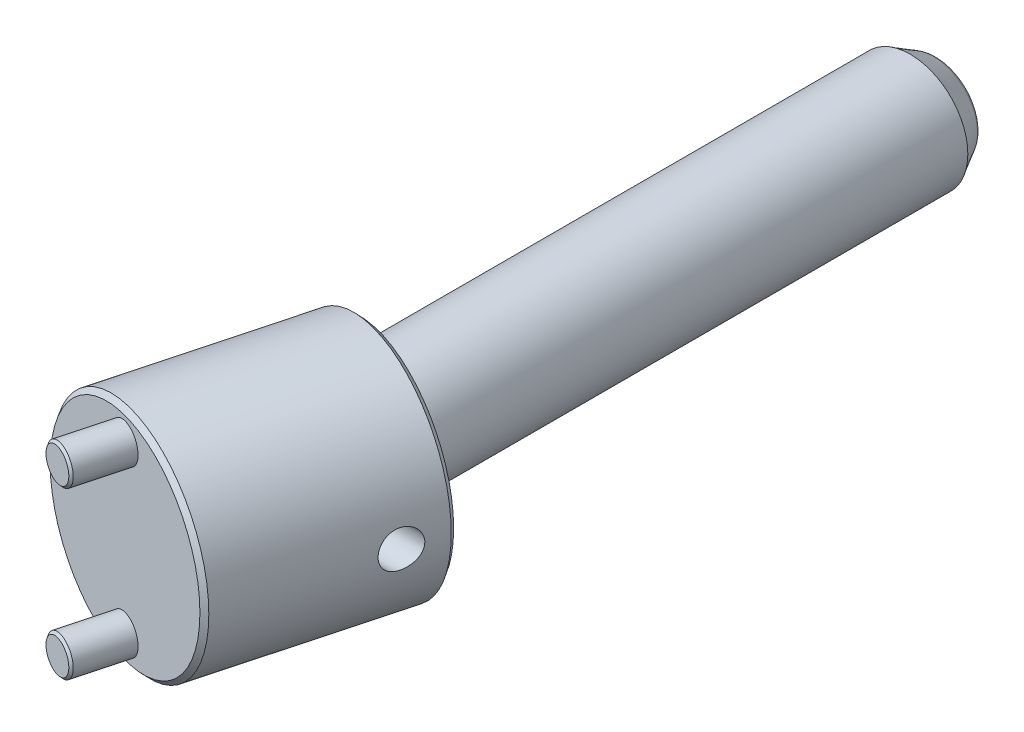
ISO-10303-21;
HEADER;
FILE_DESCRIPTION(('STEP AP214'),'2;1');
FILE_NAME('part.step','',(''),(''),'','','');
FILE_SCHEMA(('AUTOMOTIVE_DESIGN { 1 0 10303 214 1 1 1 1 }'));
ENDSEC;
DATA;
#1=APPLICATION_CONTEXT('core data for automotive mechanical design processes');
#2=APPLICATION_PROTOCOL_DEFINITION('international standard','automotive_design',2000,#1);
#3=PRODUCT_CONTEXT('',#1,'mechanical');
#4=PRODUCT('Part','Part','',(#3));
#5=PRODUCT_RELATED_PRODUCT_CATEGORY('part','',(#4));
#6=PRODUCT_DEFINITION_FORMATION('','',#4);
#7=PRODUCT_DEFINITION_CONTEXT('part definition',#1,'design');
#8=PRODUCT_DEFINITION('design','',#6,#7);
#9=PRODUCT_DEFINITION_SHAPE('','',#8);
#10=(LENGTH_UNIT() NAMED_UNIT(*) SI_UNIT(.MILLI.,.METRE.));
#11=(NAMED_UNIT(*) PLANE_ANGLE_UNIT() SI_UNIT($,.RADIAN.));
#12=(NAMED_UNIT(*) SI_UNIT($,.STERADIAN.) SOLID_ANGLE_UNIT());
#13=UNCERTAINTY_MEASURE_WITH_UNIT(LENGTH_MEASURE(1.E-05),#10,'distance_accuracy_value','');
#14=(GEOMETRIC_REPRESENTATION_CONTEXT(3) GLOBAL_UNCERTAINTY_ASSIGNED_CONTEXT((#13)) GLOBAL_UNIT_ASSIGNED_CONTEXT((#10,
#11,#12)) REPRESENTATION_CONTEXT('',''));
#15=CARTESIAN_POINT('',(0.,0.,0.));
#16=DIRECTION('',(0.,0.,1.));
#17=DIRECTION('',(1.,0.,0.));
#18=AXIS2_PLACEMENT_3D('',#15,#16,#17);
#19=CARTESIAN_POINT('',(0.,0.,-125.));
#20=DIRECTION('',(0.,0.,-1.));
#21=DIRECTION('',(0.,1.,0.));
#22=AXIS2_PLACEMENT_3D('',#19,#20,#21);
#23=PLANE('',#22);
#24=CARTESIAN_POINT('',(0.,0.,-125.));
#25=DIRECTION('',(0.,0.,1.));
#26=DIRECTION('',(-1.,0.,0.));
#27=AXIS2_PLACEMENT_3D('',#24,#25,#26);
#28=CIRCLE('',#27,7.881197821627);
#29=CARTESIAN_POINT('',(-7.8811978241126,0.,-125.));
#30=VERTEX_POINT('',#29);
#31=CARTESIAN_POINT('',(7.8811978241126,0.,-125.));
#32=VERTEX_POINT('',#31);
#33=EDGE_CURVE('P0_E38',#30,#32,#28,.T.);
#34=ORIENTED_EDGE('',*,*,#33,.F.);
#35=CARTESIAN_POINT('',(0.,0.,-125.));
#36=DIRECTION('',(0.,0.,1.));
#37=DIRECTION('',(1.,0.,0.));
#38=AXIS2_PLACEMENT_3D('',#35,#36,#37);
#39=CIRCLE('',#38,7.881197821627);
#40=EDGE_CURVE('P0_E42',#32,#30,#39,.T.);
#41=ORIENTED_EDGE('',*,*,#40,.F.);
#42=EDGE_LOOP('',(#34,#41));
#43=FACE_BOUND('',#42,.T.);
#44=ADVANCED_FACE('P0_F17',(#43),#23,.T.);
#45=CARTESIAN_POINT('',(0.,0.,-123.));
#46=DIRECTION('',(0.,0.,-1.));
#47=DIRECTION('',(0.999976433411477,-0.00686532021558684,0.));
#48=AXIS2_PLACEMENT_3D('',#45,#46,#47);
#49=TOROIDAL_SURFACE('',#48,7.881197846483,2.);
#50=ORIENTED_EDGE('',*,*,#33,.T.);
#51=ORIENTED_EDGE('',*,*,#40,.T.);
#52=EDGE_LOOP('',(#50,#51));
#53=FACE_BOUND('',#52,.T.);
#54=CARTESIAN_POINT('',(0.,0.,-124.000000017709));
#55=DIRECTION('',(0.,0.,1.));
#56=DIRECTION('',(1.,0.,0.));
#57=AXIS2_PLACEMENT_3D('',#54,#55,#56);
#58=CIRCLE('',#57,9.6132486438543);
#59=CARTESIAN_POINT('',(9.6132486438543,0.,-124.000000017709));
#60=VERTEX_POINT('',#59);
#61=EDGE_CURVE('P0_E48',#60,#60,#58,.T.);
#62=ORIENTED_EDGE('',*,*,#61,.F.);
#63=EDGE_LOOP('',(#62));
#64=FACE_BOUND('',#63,.T.);
#65=ADVANCED_FACE('P0_F40',(#53,#64),#49,.T.);
#66=CARTESIAN_POINT('',(0.,0.,37.5));
#67=DIRECTION('',(0.,0.,-1.));
#68=DIRECTION('',(0.,1.,0.));
#69=AXIS2_PLACEMENT_3D('',#66,#67,#68);
#70=PLANE('',#69);
#71=CARTESIAN_POINT('',(0.,0.,37.5000002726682));
#72=DIRECTION('',(0.,0.,-1.));
#73=DIRECTION('',(0.,1.,0.));
#74=AXIS2_PLACEMENT_3D('',#71,#72,#73);
#75=CIRCLE('',#74,11.499999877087);
#76=CARTESIAN_POINT('',(0.,11.499999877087,37.5000002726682));
#77=VERTEX_POINT('',#76);
#78=EDGE_CURVE('P0_E85',#77,#77,#75,.T.);
#79=ORIENTED_EDGE('',*,*,#78,.F.);
#80=EDGE_LOOP('',(#79));
#81=FACE_BOUND('',#80,.T.);
#82=ADVANCED_FACE('P0_F76',(#81),#70,.F.);
#83=CARTESIAN_POINT('',(4.30940107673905,0.,17.));
#84=DIRECTION('',(1.,0.,0.));
#85=DIRECTION('',(0.,0.,1.));
#86=AXIS2_PLACEMENT_3D('',#83,#84,#85);
#87=CONICAL_SURFACE('',#86,3.9999999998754,1.04719755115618);
#88=CARTESIAN_POINT('',(1.99999999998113,0.,16.9999999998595));
#89=VERTEX_POINT('',#88);
#90=VERTEX_LOOP('',#89);
#91=FACE_BOUND('',#90,.T.);
#92=CARTESIAN_POINT('',(4.309401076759,0.,17.));
#93=DIRECTION('',(1.,0.,0.));
#94=DIRECTION('',(0.,0.,1.));
#95=AXIS2_PLACEMENT_3D('',#92,#93,#94);
#96=CIRCLE('',#95,4.);
#97=CARTESIAN_POINT('',(4.309401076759,0.,21.));
#98=VERTEX_POINT('',#97);
#99=EDGE_CURVE('P0_E82',#98,#98,#96,.T.);
#100=ORIENTED_EDGE('',*,*,#99,.T.);
#101=EDGE_LOOP('',(#100));
#102=FACE_BOUND('',#101,.T.);
#103=ADVANCED_FACE('P0_F116',(#91,#102),#87,.F.);
#104=CARTESIAN_POINT('',(0.,0.,-119.000000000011));
#105=DIRECTION('',(0.,0.,1.));
#106=DIRECTION('',(0.,-1.,0.));
#107=AXIS2_PLACEMENT_3D('',#104,#105,#106);
#108=CONICAL_SURFACE('',#107,12.5000000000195,0.5235987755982);
#109=CARTESIAN_POINT('',(0.,0.,-119.));
#110=DIRECTION('',(0.,0.,-1.));
#111=DIRECTION('',(0.,1.,0.));
#112=AXIS2_PLACEMENT_3D('',#109,#110,#111);
#113=CIRCLE('',#112,12.5);
#114=CARTESIAN_POINT('',(0.,12.5,-119.));
#115=VERTEX_POINT('',#114);
#116=EDGE_CURVE('P0_E92',#115,#115,#113,.F.);
#117=ORIENTED_EDGE('',*,*,#116,.F.);
#118=EDGE_LOOP('',(#117));
#119=FACE_BOUND('',#118,.T.);
#120=ORIENTED_EDGE('',*,*,#61,.T.);
#121=EDGE_LOOP('',(#120));
#122=FACE_BOUND('',#121,.T.);
#123=ADVANCED_FACE('P0_F108',(#119,#122),#108,.T.);
#124=CARTESIAN_POINT('',(0.,0.,36.4999998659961));
#125=DIRECTION('',(0.,0.,-1.));
#126=DIRECTION('',(0.,1.,0.));
#127=AXIS2_PLACEMENT_3D('',#124,#125,#126);
#128=CONICAL_SURFACE('',#127,12.5000002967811,0.785398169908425);
#129=CARTESIAN_POINT('',(0.,0.,36.499999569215));
#130=DIRECTION('',(0.,0.,-1.));
#131=DIRECTION('',(0.,1.,0.));
#132=AXIS2_PLACEMENT_3D('',#129,#130,#131);
#133=CIRCLE('',#132,12.5);
#134=CARTESIAN_POINT('',(0.,12.5,36.499999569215));
#135=VERTEX_POINT('',#134);
#136=EDGE_CURVE('P0_E28',#135,#135,#133,.T.);
#137=ORIENTED_EDGE('',*,*,#136,.F.);
#138=EDGE_LOOP('',(#137));
#139=FACE_BOUND('',#138,.T.);
#140=ORIENTED_EDGE('',*,*,#78,.T.);
#141=EDGE_LOOP('',(#140));
#142=FACE_BOUND('',#141,.T.);
#143=ADVANCED_FACE('P0_F105',(#139,#142),#128,.T.);
#144=CARTESIAN_POINT('',(1.375,0.,17.));
#145=DIRECTION('',(1.,0.,0.));
#146=DIRECTION('',(0.,0.,1.));
#147=AXIS2_PLACEMENT_3D('',#144,#145,#146);
#148=CYLINDRICAL_SURFACE('',#147,4.);
#149=ORIENTED_EDGE('',*,*,#99,.F.);
#150=EDGE_LOOP('',(#149));
#151=FACE_BOUND('',#150,.T.);
#152=CARTESIAN_POINT('',(12.5,0.,21.));
#153=CARTESIAN_POINT('',(12.4999998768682,0.109267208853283,20.9999998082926));
#154=CARTESIAN_POINT('',(12.4985638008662,0.218537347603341,20.9955187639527));
#155=CARTESIAN_POINT('',(12.4928582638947,0.436308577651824,20.9776347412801));
#156=CARTESIAN_POINT('',(12.4885877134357,0.544809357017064,20.9642283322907));
#157=CARTESIAN_POINT('',(12.4773197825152,0.760358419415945,20.9285872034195));
#158=CARTESIAN_POINT('',(12.4703188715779,0.867404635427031,20.9063410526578));
#159=CARTESIAN_POINT('',(12.4537844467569,1.07914970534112,20.853228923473));
#160=CARTESIAN_POINT('',(12.4442499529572,1.18384763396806,20.8223596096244));
#161=CARTESIAN_POINT('',(12.412260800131,1.49277788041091,20.7173557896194));
#162=CARTESIAN_POINT('',(12.3863805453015,1.69256281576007,20.6307055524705));
#163=CARTESIAN_POINT('',(12.3281610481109,2.07458913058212,20.4268128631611));
#164=CARTESIAN_POINT('',(12.295822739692,2.25683304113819,20.3095748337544));
#165=CARTESIAN_POINT('',(12.2269279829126,2.60472253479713,20.043795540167));
#166=CARTESIAN_POINT('',(12.1902760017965,2.76972880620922,19.8944408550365));
#167=CARTESIAN_POINT('',(12.1174284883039,3.07283077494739,19.5704010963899));
#168=CARTESIAN_POINT('',(12.0812330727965,3.21091970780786,19.3957096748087));
#169=CARTESIAN_POINT('',(12.01237020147,3.45978450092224,19.0203675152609));
#170=CARTESIAN_POINT('',(11.9798194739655,3.56975347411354,18.8191582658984));
#171=CARTESIAN_POINT('',(11.9233663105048,3.75402351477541,18.399892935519));
#172=CARTESIAN_POINT('',(11.8994614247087,3.82833468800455,18.1818416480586));
#173=CARTESIAN_POINT('',(11.8640030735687,3.93682830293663,17.7422935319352));
#174=CARTESIAN_POINT('',(11.8520853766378,3.97219740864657,17.5211198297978));
#175=CARTESIAN_POINT('',(11.8408707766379,4.00551082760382,17.0756810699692));
#176=CARTESIAN_POINT('',(11.8415703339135,4.00346563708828,16.8514168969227));
#177=CARTESIAN_POINT('',(11.8551904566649,3.96293460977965,16.4160865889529));
#178=CARTESIAN_POINT('',(11.8676003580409,3.92597140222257,16.2048599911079));
#179=CARTESIAN_POINT('',(11.9024113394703,3.81912665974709,15.791778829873));
#180=CARTESIAN_POINT('',(11.9248135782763,3.74924130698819,15.5899253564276));
#181=CARTESIAN_POINT('',(11.9774670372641,3.5774893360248,15.1977500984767));
#182=CARTESIAN_POINT('',(12.0078322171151,3.47515345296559,15.0076498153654));
#183=CARTESIAN_POINT('',(12.0729382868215,3.2417276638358,14.6468343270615));
#184=CARTESIAN_POINT('',(12.107680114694,3.11063158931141,14.4761232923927));
#185=CARTESIAN_POINT('',(12.1796519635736,2.81604951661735,14.1503715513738));
#186=CARTESIAN_POINT('',(12.2169216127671,2.65131653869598,13.9964671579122));
#187=CARTESIAN_POINT('',(12.2883204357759,2.29773509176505,13.7180823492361));
#188=CARTESIAN_POINT('',(12.3224482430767,2.10887621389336,13.5936147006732));
#189=CARTESIAN_POINT('',(12.368603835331,1.8105187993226,13.4313785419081));
#190=CARTESIAN_POINT('',(12.3832112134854,1.70799133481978,13.3811846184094));
#191=CARTESIAN_POINT('',(12.4102662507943,1.49879447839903,13.2896595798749));
#192=CARTESIAN_POINT('',(12.4227147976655,1.39212681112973,13.2483248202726));
#193=CARTESIAN_POINT('',(12.4450730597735,1.17558171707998,13.1749428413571));
#194=CARTESIAN_POINT('',(12.4549867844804,1.0657096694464,13.1428809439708));
#195=CARTESIAN_POINT('',(12.4720081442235,0.843458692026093,13.0882661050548));
#196=CARTESIAN_POINT('',(12.4791170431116,0.731080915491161,13.0657088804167));
#197=CARTESIAN_POINT('',(12.4897717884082,0.515800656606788,13.0320501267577));
#198=CARTESIAN_POINT('',(12.4935992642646,0.413053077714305,13.0200402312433));
#199=CARTESIAN_POINT('',(12.498713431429,0.206871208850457,13.0040150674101));
#200=CARTESIAN_POINT('',(12.5000001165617,0.103436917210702,12.9999998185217));
#201=CARTESIAN_POINT('',(12.4999998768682,-0.109267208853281,13.0000001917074));
#202=CARTESIAN_POINT('',(12.4985638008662,-0.218537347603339,13.0044812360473));
#203=CARTESIAN_POINT('',(12.4928582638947,-0.436308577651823,13.0223652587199));
#204=CARTESIAN_POINT('',(12.4885877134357,-0.544809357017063,13.0357716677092));
#205=CARTESIAN_POINT('',(12.4773197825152,-0.760358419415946,13.0714127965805));
#206=CARTESIAN_POINT('',(12.4703188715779,-0.867404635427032,13.0936589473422));
#207=CARTESIAN_POINT('',(12.4537844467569,-1.07914970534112,13.146771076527));
#208=CARTESIAN_POINT('',(12.4442499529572,-1.18384763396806,13.1776403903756));
#209=CARTESIAN_POINT('',(12.412260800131,-1.4927778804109,13.2826442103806));
#210=CARTESIAN_POINT('',(12.3863805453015,-1.69256281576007,13.3692944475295));
#211=CARTESIAN_POINT('',(12.3281610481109,-2.07458913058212,13.5731871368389));
#212=CARTESIAN_POINT('',(12.295822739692,-2.25683304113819,13.6904251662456));
#213=CARTESIAN_POINT('',(12.2269279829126,-2.60472253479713,13.956204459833));
#214=CARTESIAN_POINT('',(12.1902760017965,-2.76972880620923,14.1055591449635));
#215=CARTESIAN_POINT('',(12.1174284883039,-3.0728307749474,14.4295989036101));
#216=CARTESIAN_POINT('',(12.0812330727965,-3.21091970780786,14.6042903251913));
#217=CARTESIAN_POINT('',(12.01237020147,-3.45978450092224,14.9796324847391));
#218=CARTESIAN_POINT('',(11.9798194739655,-3.56975347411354,15.1808417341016));
#219=CARTESIAN_POINT('',(11.9233663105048,-3.75402351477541,15.600107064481));
#220=CARTESIAN_POINT('',(11.8994614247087,-3.82833468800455,15.8181583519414));
#221=CARTESIAN_POINT('',(11.8640030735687,-3.93682830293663,16.2577064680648));
#222=CARTESIAN_POINT('',(11.8520853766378,-3.97219740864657,16.4788801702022));
#223=CARTESIAN_POINT('',(11.8408707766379,-4.00551082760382,16.9243189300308));
#224=CARTESIAN_POINT('',(11.8415703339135,-4.00346563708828,17.1485831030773));
#225=CARTESIAN_POINT('',(11.8551904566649,-3.96293460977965,17.583913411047));
#226=CARTESIAN_POINT('',(11.8676003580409,-3.92597140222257,17.7951400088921));
#227=CARTESIAN_POINT('',(11.9024113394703,-3.81912665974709,18.208221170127));
#228=CARTESIAN_POINT('',(11.9248135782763,-3.74924130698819,18.4100746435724));
#229=CARTESIAN_POINT('',(11.9774670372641,-3.5774893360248,18.8022499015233));
#230=CARTESIAN_POINT('',(12.0078322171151,-3.47515345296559,18.9923501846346));
#231=CARTESIAN_POINT('',(12.0729382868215,-3.2417276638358,19.3531656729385));
#232=CARTESIAN_POINT('',(12.107680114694,-3.11063158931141,19.5238767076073));
#233=CARTESIAN_POINT('',(12.1796519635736,-2.81604951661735,19.8496284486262));
#234=CARTESIAN_POINT('',(12.2169216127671,-2.65131653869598,20.0035328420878));
#235=CARTESIAN_POINT('',(12.2883204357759,-2.29773509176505,20.2819176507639));
#236=CARTESIAN_POINT('',(12.3224482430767,-2.10887621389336,20.4063852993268));
#237=CARTESIAN_POINT('',(12.368603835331,-1.8105187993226,20.5686214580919));
#238=CARTESIAN_POINT('',(12.3832112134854,-1.70799133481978,20.6188153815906));
#239=CARTESIAN_POINT('',(12.4102662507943,-1.49879447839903,20.7103404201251));
#240=CARTESIAN_POINT('',(12.4227147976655,-1.39212681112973,20.7516751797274));
#241=CARTESIAN_POINT('',(12.4450730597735,-1.17558171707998,20.8250571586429));
#242=CARTESIAN_POINT('',(12.4549867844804,-1.0657096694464,20.8571190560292));
#243=CARTESIAN_POINT('',(12.4720081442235,-0.843458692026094,20.9117338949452));
#244=CARTESIAN_POINT('',(12.4791170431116,-0.731080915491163,20.9342911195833));
#245=CARTESIAN_POINT('',(12.4897717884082,-0.515800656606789,20.9679498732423));
#246=CARTESIAN_POINT('',(12.4935992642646,-0.413053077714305,20.9799597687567));
#247=CARTESIAN_POINT('',(12.498713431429,-0.206871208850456,20.9959849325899));
#248=CARTESIAN_POINT('',(12.5000001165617,-0.103436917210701,21.0000001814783));
#249=CARTESIAN_POINT('',(12.5,0.,21.));
#250=B_SPLINE_CURVE_WITH_KNOTS('',3,(#152,#153,#154,#155,#156,#157,#158,#159,#160,#161,#162,
#163,#164,#165,#166,#167,#168,#169,#170,#171,#172,#173,#174,#175,#176,#177,#178,#179,#180,#181,
#182,#183,#184,#185,#186,#187,#188,#189,#190,#191,#192,#193,#194,#195,#196,#197,#198,#199,#200,
#201,#202,#203,#204,#205,#206,#207,#208,#209,#210,#211,#212,#213,#214,#215,#216,#217,#218,#219,
#220,#221,#222,#223,#224,#225,#226,#227,#228,#229,#230,#231,#232,#233,#234,#235,#236,#237,#238,
#239,#240,#241,#242,#243,#244,#245,#246,#247,#248,#249),.UNSPECIFIED.,.T.,.F.,(4,2,2,2,2,2,2,2,
2,2,2,2,2,2,2,2,2,2,2,2,2,2,2,2,2,2,2,2,2,2,2,2,2,2,2,2,2,2,2,2,2,2,2,2,2,2,2,2,4),(0.,
0.327705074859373,0.655536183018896,0.983792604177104,1.31217617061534,1.96678919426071,
2.62130761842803,3.29492000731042,3.96870146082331,4.66006760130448,5.35123768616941,
6.0207071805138,6.68998886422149,7.33137068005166,7.97282689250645,8.62401811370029,
9.27534913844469,9.95775723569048,10.6404607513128,10.9853574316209,11.3301119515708,
11.6743177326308,12.0183682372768,12.3285868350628,12.6388061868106,12.9665112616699,
13.2943423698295,13.6225987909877,13.9509823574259,14.6055953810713,15.2601138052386,
15.933726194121,16.6075076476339,17.298873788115,17.99004387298,18.6595133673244,
19.3287950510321,19.9701768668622,20.611633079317,21.2628243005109,21.9141553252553,
22.596563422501,23.2792669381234,23.6241636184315,23.9689181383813,24.3131239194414,
24.6571744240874,24.9673930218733,25.2776123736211),.UNSPECIFIED.);
#251=CARTESIAN_POINT('',(12.5,0.,21.));
#252=VERTEX_POINT('',#251);
#253=EDGE_CURVE('P0_E11',#252,#252,#250,.T.);
#254=ORIENTED_EDGE('',*,*,#253,.F.);
#255=EDGE_LOOP('',(#254));
#256=FACE_BOUND('',#255,.T.);
#257=ADVANCED_FACE('P0_F107',(#151,#256),#148,.F.);
#258=CARTESIAN_POINT('',(0.,0.,45.625));
#259=DIRECTION('',(0.,0.,-1.));
#260=DIRECTION('',(0.,1.,0.));
#261=AXIS2_PLACEMENT_3D('',#258,#259,#260);
#262=CYLINDRICAL_SURFACE('',#261,12.5);
#263=ORIENTED_EDGE('',*,*,#116,.T.);
#264=EDGE_LOOP('',(#263));
#265=FACE_BOUND('',#264,.T.);
#266=ORIENTED_EDGE('',*,*,#136,.T.);
#267=EDGE_LOOP('',(#266));
#268=FACE_BOUND('',#267,.T.);
#269=ORIENTED_EDGE('',*,*,#253,.T.);
#270=EDGE_LOOP('',(#269));
#271=FACE_BOUND('',#270,.T.);
#272=ADVANCED_FACE('P0_F102',(#265,#268,#271),#262,.T.);
#273=CLOSED_SHELL('',(#44,#65,#82,#103,#123,#143,#257,#272));
#274=MANIFOLD_SOLID_BREP('P0_B1',#273);
#275=CARTESIAN_POINT('',(-9.92305643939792,0.,56.3518673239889));
#276=DIRECTION('',(-0.258819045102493,0.,0.965925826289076));
#277=DIRECTION('',(-0.965925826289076,0.,-0.258819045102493));
#278=AXIS2_PLACEMENT_3D('',#275,#276,#277);
#279=PLANE('',#278);
#280=CARTESIAN_POINT('',(-9.92305643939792,18.,56.3518673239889));
#281=DIRECTION('',(-0.258819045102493,0.,0.965925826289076));
#282=DIRECTION('',(-0.965925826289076,0.,-0.258819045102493));
#283=AXIS2_PLACEMENT_3D('',#280,#281,#282);
#284=CIRCLE('',#283,3.50000030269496);
#285=CARTESIAN_POINT('',(-13.3037971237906,18.,55.446000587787));
#286=VERTEX_POINT('',#285);
#287=EDGE_CURVE('P1_E17',#286,#286,#284,.F.);
#288=ORIENTED_EDGE('',*,*,#287,.F.);
#289=EDGE_LOOP('',(#288));
#290=FACE_BOUND('',#289,.T.);
#291=ADVANCED_FACE('P1_F14',(#290),#279,.T.);
#292=CARTESIAN_POINT('',(-9.92305643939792,0.,56.3518673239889));
#293=DIRECTION('',(-0.258819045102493,0.,0.965925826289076));
#294=DIRECTION('',(-0.965925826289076,0.,-0.258819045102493));
#295=AXIS2_PLACEMENT_3D('',#292,#293,#294);
#296=PLANE('',#295);
#297=CARTESIAN_POINT('',(-9.92305643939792,-18.,56.3518673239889));
#298=DIRECTION('',(-0.258819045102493,0.,0.965925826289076));
#299=DIRECTION('',(-0.965925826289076,0.,-0.258819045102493));
#300=AXIS2_PLACEMENT_3D('',#297,#298,#299);
#301=CIRCLE('',#300,3.50000030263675);
#302=CARTESIAN_POINT('',(-13.3037971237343,-18.,55.446000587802));
#303=VERTEX_POINT('',#302);
#304=EDGE_CURVE('P1_E121',#303,#303,#301,.F.);
#305=ORIENTED_EDGE('',*,*,#304,.F.);
#306=EDGE_LOOP('',(#305));
#307=FACE_BOUND('',#306,.T.);
#308=ADVANCED_FACE('P1_F111',(#307),#296,.T.);
#309=CARTESIAN_POINT('',(3.59087759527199E-13,0.,37.4999999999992));
#310=DIRECTION('',(0.,0.,1.));
#311=DIRECTION('',(-1.,0.,0.));
#312=AXIS2_PLACEMENT_3D('',#309,#310,#311);
#313=PLANE('',#312);
#314=CARTESIAN_POINT('',(-9.31546506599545E-13,0.,37.4999999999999));
#315=DIRECTION('',(0.,0.,1.));
#316=DIRECTION('',(-1.,0.,0.));
#317=AXIS2_PLACEMENT_3D('',#314,#315,#316);
#318=CIRCLE('',#317,12.5);
#319=CARTESIAN_POINT('',(-12.5000000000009,0.,37.4999999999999));
#320=VERTEX_POINT('',#319);
#321=EDGE_CURVE('P1_E36',#320,#320,#318,.F.);
#322=ORIENTED_EDGE('',*,*,#321,.T.);
#323=EDGE_LOOP('',(#322));
#324=FACE_BOUND('',#323,.T.);
#325=ADVANCED_FACE('P1_F108',(#324),#313,.F.);
#326=CARTESIAN_POINT('',(-9.79364661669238,18.,55.8689032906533));
#327=DIRECTION('',(0.258819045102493,0.,-0.965925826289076));
#328=DIRECTION('',(0.965925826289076,0.,0.258819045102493));
#329=AXIS2_PLACEMENT_3D('',#326,#327,#328);
#330=CONICAL_SURFACE('',#329,4.00000150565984,0.785398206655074);
#331=CARTESIAN_POINT('',(-9.79364622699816,18.,55.8689018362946));
#332=DIRECTION('',(-0.258819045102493,0.,0.965925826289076));
#333=DIRECTION('',(-0.965925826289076,0.,-0.258819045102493));
#334=AXIS2_PLACEMENT_3D('',#331,#332,#333);
#335=CIRCLE('',#334,4.);
#336=CARTESIAN_POINT('',(-13.6573495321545,18.,54.8336256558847));
#337=VERTEX_POINT('',#336);
#338=EDGE_CURVE('P1_E33',#337,#337,#335,.F.);
#339=ORIENTED_EDGE('',*,*,#338,.F.);
#340=EDGE_LOOP('',(#339));
#341=FACE_BOUND('',#340,.T.);
#342=ORIENTED_EDGE('',*,*,#287,.T.);
#343=EDGE_LOOP('',(#342));
#344=FACE_BOUND('',#343,.T.);
#345=ADVANCED_FACE('P1_F104',(#341,#344),#330,.T.);
#346=CARTESIAN_POINT('',(-9.79364661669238,-18.,55.8689032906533));
#347=DIRECTION('',(0.258819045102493,0.,-0.965925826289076));
#348=DIRECTION('',(0.965925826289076,0.,0.258819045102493));
#349=AXIS2_PLACEMENT_3D('',#346,#347,#348);
#350=CONICAL_SURFACE('',#349,4.00000150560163,0.785398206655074);
#351=CARTESIAN_POINT('',(-9.79364622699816,-18.,55.8689018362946));
#352=DIRECTION('',(-0.258819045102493,0.,0.965925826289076));
#353=DIRECTION('',(-0.965925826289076,0.,-0.258819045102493));
#354=AXIS2_PLACEMENT_3D('',#351,#352,#353);
#355=CIRCLE('',#354,4.);
#356=CARTESIAN_POINT('',(-13.6573495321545,-18.,54.8336256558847));
#357=VERTEX_POINT('',#356);
#358=EDGE_CURVE('P1_E29',#357,#357,#355,.F.);
#359=ORIENTED_EDGE('',*,*,#358,.F.);
#360=EDGE_LOOP('',(#359));
#361=FACE_BOUND('',#360,.T.);
#362=ORIENTED_EDGE('',*,*,#304,.T.);
#363=EDGE_LOOP('',(#362));
#364=FACE_BOUND('',#363,.T.);
#365=ADVANCED_FACE('P1_F99',(#361,#364),#350,.T.);
#366=CARTESIAN_POINT('',(-9.33281230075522E-13,0.,-15.8125000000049));
#367=DIRECTION('',(0.,0.,1.));
#368=DIRECTION('',(-1.,0.,0.));
#369=AXIS2_PLACEMENT_3D('',#366,#367,#368);
#370=CYLINDRICAL_SURFACE('',#369,12.5);
#371=CARTESIAN_POINT('',(-9.31546506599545E-13,0.,-8.11850586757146E-13));
#372=DIRECTION('',(0.258819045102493,0.,-0.965925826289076));
#373=DIRECTION('',(0.965925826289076,0.,0.258819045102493));
#374=AXIS2_PLACEMENT_3D('',#371,#372,#373);
#375=ELLIPSE('',#374,12.9409522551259,12.5);
#376=CARTESIAN_POINT('',(12.4999999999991,0.,3.34936490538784));
#377=VERTEX_POINT('',#376);
#378=EDGE_CURVE('P1_E32',#377,#377,#375,.F.);
#379=ORIENTED_EDGE('',*,*,#378,.F.);
#380=EDGE_LOOP('',(#379));
#381=FACE_BOUND('',#380,.T.);
#382=ORIENTED_EDGE('',*,*,#321,.F.);
#383=EDGE_LOOP('',(#382));
#384=FACE_BOUND('',#383,.T.);
#385=CARTESIAN_POINT('',(12.4999999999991,0.,12.9999999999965));
#386=CARTESIAN_POINT('',(12.4999998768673,0.109267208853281,13.000000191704));
#387=CARTESIAN_POINT('',(12.4985638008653,0.218537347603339,13.0044812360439));
#388=CARTESIAN_POINT('',(12.4928582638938,0.436308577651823,13.0223652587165));
#389=CARTESIAN_POINT('',(12.4885877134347,0.544809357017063,13.0357716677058));
#390=CARTESIAN_POINT('',(12.4773197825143,0.760358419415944,13.0714127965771));
#391=CARTESIAN_POINT('',(12.4703188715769,0.867404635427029,13.0936589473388));
#392=CARTESIAN_POINT('',(12.4537844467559,1.07914970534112,13.1467710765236));
#393=CARTESIAN_POINT('',(12.4442499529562,1.18384763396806,13.1776403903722));
#394=CARTESIAN_POINT('',(12.41226080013,1.49277788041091,13.2826442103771));
#395=CARTESIAN_POINT('',(12.3863805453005,1.69256281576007,13.3692944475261));
#396=CARTESIAN_POINT('',(12.32816104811,2.07458913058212,13.5731871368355));
#397=CARTESIAN_POINT('',(12.295822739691,2.25683304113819,13.6904251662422));
#398=CARTESIAN_POINT('',(12.2269279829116,2.60472253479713,13.9562044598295));
#399=CARTESIAN_POINT('',(12.1902760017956,2.76972880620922,14.10555914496));
#400=CARTESIAN_POINT('',(12.1174284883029,3.07283077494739,14.4295989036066));
#401=CARTESIAN_POINT('',(12.0812330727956,3.21091970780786,14.6042903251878));
#402=CARTESIAN_POINT('',(12.0123702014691,3.45978450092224,14.9796324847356));
#403=CARTESIAN_POINT('',(11.9798194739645,3.56975347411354,15.1808417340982));
#404=CARTESIAN_POINT('',(11.9233663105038,3.75402351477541,15.6001070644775));
#405=CARTESIAN_POINT('',(11.8994614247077,3.82833468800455,15.818158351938));
#406=CARTESIAN_POINT('',(11.8640030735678,3.93682830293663,16.2577064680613));
#407=CARTESIAN_POINT('',(11.8520853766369,3.97219740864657,16.4788801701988));
#408=CARTESIAN_POINT('',(11.840870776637,4.00551082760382,16.9243189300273));
#409=CARTESIAN_POINT('',(11.8415703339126,4.00346563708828,17.1485831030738));
#410=CARTESIAN_POINT('',(11.855190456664,3.96293460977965,17.5839134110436));
#411=CARTESIAN_POINT('',(11.86760035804,3.92597140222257,17.7951400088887));
#412=CARTESIAN_POINT('',(11.9024113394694,3.81912665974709,18.2082211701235));
#413=CARTESIAN_POINT('',(11.9248135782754,3.74924130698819,18.4100746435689));
#414=CARTESIAN_POINT('',(11.9774670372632,3.5774893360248,18.8022499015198));
#415=CARTESIAN_POINT('',(12.0078322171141,3.47515345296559,18.9923501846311));
#416=CARTESIAN_POINT('',(12.0729382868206,3.2417276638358,19.353165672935));
#417=CARTESIAN_POINT('',(12.107680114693,3.11063158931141,19.5238767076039));
#418=CARTESIAN_POINT('',(12.1796519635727,2.81604951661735,19.8496284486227));
#419=CARTESIAN_POINT('',(12.2169216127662,2.65131653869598,20.0035328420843));
#420=CARTESIAN_POINT('',(12.2883204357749,2.29773509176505,20.2819176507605));
#421=CARTESIAN_POINT('',(12.3224482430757,2.10887621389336,20.4063852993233));
#422=CARTESIAN_POINT('',(12.3686038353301,1.8105187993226,20.5686214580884));
#423=CARTESIAN_POINT('',(12.3832112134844,1.70799133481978,20.6188153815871));
#424=CARTESIAN_POINT('',(12.4102662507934,1.49879447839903,20.7103404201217));
#425=CARTESIAN_POINT('',(12.4227147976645,1.39212681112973,20.751675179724));
#426=CARTESIAN_POINT('',(12.4450730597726,1.17558171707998,20.8250571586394));
#427=CARTESIAN_POINT('',(12.4549867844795,1.0657096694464,20.8571190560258));
#428=CARTESIAN_POINT('',(12.4720081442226,0.843458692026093,20.9117338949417));
#429=CARTESIAN_POINT('',(12.4791170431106,0.731080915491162,20.9342911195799));
#430=CARTESIAN_POINT('',(12.4897717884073,0.515800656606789,20.9679498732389));
#431=CARTESIAN_POINT('',(12.4935992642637,0.413053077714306,20.9799597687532));
#432=CARTESIAN_POINT('',(12.498713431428,0.206871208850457,20.9959849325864));
#433=CARTESIAN_POINT('',(12.5000001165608,0.103436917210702,21.0000001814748));
#434=CARTESIAN_POINT('',(12.4999998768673,-0.109267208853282,20.9999998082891));
#435=CARTESIAN_POINT('',(12.4985638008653,-0.21853734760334,20.9955187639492));
#436=CARTESIAN_POINT('',(12.4928582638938,-0.436308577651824,20.9776347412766));
#437=CARTESIAN_POINT('',(12.4885877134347,-0.544809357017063,20.9642283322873));
#438=CARTESIAN_POINT('',(12.4773197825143,-0.760358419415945,20.928587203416));
#439=CARTESIAN_POINT('',(12.4703188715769,-0.86740463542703,20.9063410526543));
#440=CARTESIAN_POINT('',(12.4537844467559,-1.07914970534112,20.8532289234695));
#441=CARTESIAN_POINT('',(12.4442499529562,-1.18384763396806,20.8223596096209));
#442=CARTESIAN_POINT('',(12.41226080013,-1.4927778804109,20.717355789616));
#443=CARTESIAN_POINT('',(12.3863805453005,-1.69256281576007,20.630705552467));
#444=CARTESIAN_POINT('',(12.32816104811,-2.07458913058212,20.4268128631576));
#445=CARTESIAN_POINT('',(12.295822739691,-2.25683304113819,20.3095748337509));
#446=CARTESIAN_POINT('',(12.2269279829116,-2.60472253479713,20.0437955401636));
#447=CARTESIAN_POINT('',(12.1902760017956,-2.76972880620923,19.8944408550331));
#448=CARTESIAN_POINT('',(12.1174284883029,-3.0728307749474,19.5704010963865));
#449=CARTESIAN_POINT('',(12.0812330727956,-3.21091970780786,19.3957096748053));
#450=CARTESIAN_POINT('',(12.0123702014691,-3.45978450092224,19.0203675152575));
#451=CARTESIAN_POINT('',(11.9798194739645,-3.56975347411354,18.8191582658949));
#452=CARTESIAN_POINT('',(11.9233663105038,-3.75402351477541,18.3998929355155));
#453=CARTESIAN_POINT('',(11.8994614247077,-3.82833468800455,18.1818416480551));
#454=CARTESIAN_POINT('',(11.8640030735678,-3.93682830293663,17.7422935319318));
#455=CARTESIAN_POINT('',(11.8520853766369,-3.97219740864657,17.5211198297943));
#456=CARTESIAN_POINT('',(11.840870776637,-4.00551082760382,17.0756810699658));
#457=CARTESIAN_POINT('',(11.8415703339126,-4.00346563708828,16.8514168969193));
#458=CARTESIAN_POINT('',(11.855190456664,-3.96293460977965,16.4160865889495));
#459=CARTESIAN_POINT('',(11.86760035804,-3.92597140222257,16.2048599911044));
#460=CARTESIAN_POINT('',(11.9024113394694,-3.81912665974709,15.7917788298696));
#461=CARTESIAN_POINT('',(11.9248135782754,-3.74924130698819,15.5899253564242));
#462=CARTESIAN_POINT('',(11.9774670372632,-3.5774893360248,15.1977500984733));
#463=CARTESIAN_POINT('',(12.0078322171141,-3.47515345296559,15.007649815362));
#464=CARTESIAN_POINT('',(12.0729382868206,-3.2417276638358,14.6468343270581));
#465=CARTESIAN_POINT('',(12.107680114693,-3.11063158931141,14.4761232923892));
#466=CARTESIAN_POINT('',(12.1796519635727,-2.81604951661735,14.1503715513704));
#467=CARTESIAN_POINT('',(12.2169216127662,-2.65131653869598,13.9964671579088));
#468=CARTESIAN_POINT('',(12.2883204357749,-2.29773509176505,13.7180823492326));
#469=CARTESIAN_POINT('',(12.3224482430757,-2.10887621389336,13.5936147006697));
#470=CARTESIAN_POINT('',(12.3686038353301,-1.8105187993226,13.4313785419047));
#471=CARTESIAN_POINT('',(12.3832112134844,-1.70799133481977,13.381184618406));
#472=CARTESIAN_POINT('',(12.4102662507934,-1.49879447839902,13.2896595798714));
#473=CARTESIAN_POINT('',(12.4227147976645,-1.39212681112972,13.2483248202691));
#474=CARTESIAN_POINT('',(12.4450730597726,-1.17558171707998,13.1749428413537));
#475=CARTESIAN_POINT('',(12.4549867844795,-1.0657096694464,13.1428809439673));
#476=CARTESIAN_POINT('',(12.4720081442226,-0.843458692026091,13.0882661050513));
#477=CARTESIAN_POINT('',(12.4791170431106,-0.731080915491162,13.0657088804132));
#478=CARTESIAN_POINT('',(12.4897717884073,-0.51580065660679,13.0320501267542));
#479=CARTESIAN_POINT('',(12.4935992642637,-0.413053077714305,13.0200402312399));
#480=CARTESIAN_POINT('',(12.498713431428,-0.206871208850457,13.0040150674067));
#481=CARTESIAN_POINT('',(12.5000001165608,-0.103436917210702,12.9999998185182));
#482=CARTESIAN_POINT('',(12.4999999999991,0.,12.9999999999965));
#483=B_SPLINE_CURVE_WITH_KNOTS('',3,(#385,#386,#387,#388,#389,#390,#391,#392,#393,#394,#395,
#396,#397,#398,#399,#400,#401,#402,#403,#404,#405,#406,#407,#408,#409,#410,#411,#412,#413,#414,
#415,#416,#417,#418,#419,#420,#421,#422,#423,#424,#425,#426,#427,#428,#429,#430,#431,#432,#433,
#434,#435,#436,#437,#438,#439,#440,#441,#442,#443,#444,#445,#446,#447,#448,#449,#450,#451,#452,
#453,#454,#455,#456,#457,#458,#459,#460,#461,#462,#463,#464,#465,#466,#467,#468,#469,#470,#471,
#472,#473,#474,#475,#476,#477,#478,#479,#480,#481,#482),.UNSPECIFIED.,.T.,.F.,(4,2,2,2,2,2,2,2,
2,2,2,2,2,2,2,2,2,2,2,2,2,2,2,2,2,2,2,2,2,2,2,2,2,2,2,2,2,2,2,2,2,2,2,2,2,2,2,2,4),(0.,
0.327705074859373,0.655536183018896,0.983792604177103,1.31217617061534,1.9667891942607,
2.62130761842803,3.29492000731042,3.96870146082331,4.66006760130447,5.35123768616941,
6.0207071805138,6.68998886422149,7.33137068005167,7.97282689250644,8.62401811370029,
9.27534913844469,9.95775723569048,10.6404607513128,10.9853574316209,11.3301119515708,
11.6743177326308,12.0183682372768,12.3285868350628,12.6388061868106,12.9665112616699,
13.2943423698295,13.6225987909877,13.9509823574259,14.6055953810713,15.2601138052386,
15.933726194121,16.6075076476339,17.298873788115,17.99004387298,18.6595133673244,
19.3287950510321,19.9701768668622,20.611633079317,21.2628243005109,21.9141553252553,
22.596563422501,23.2792669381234,23.6241636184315,23.9689181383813,24.3131239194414,
24.6571744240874,24.9673930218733,25.2776123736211),.UNSPECIFIED.);
#484=CARTESIAN_POINT('',(12.4999999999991,0.,12.9999999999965));
#485=VERTEX_POINT('',#484);
#486=EDGE_CURVE('P1_E84',#485,#485,#483,.T.);
#487=ORIENTED_EDGE('',*,*,#486,.T.);
#488=EDGE_LOOP('',(#487));
#489=FACE_BOUND('',#488,.T.);
#490=ADVANCED_FACE('P1_F93',(#381,#384,#489),#370,.F.);
#491=CARTESIAN_POINT('',(-6.817227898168,18.,44.76075740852));
#492=DIRECTION('',(-0.258819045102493,0.,0.965925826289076));
#493=DIRECTION('',(-0.965925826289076,0.,-0.258819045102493));
#494=AXIS2_PLACEMENT_3D('',#491,#492,#493);
#495=CYLINDRICAL_SURFACE('',#494,4.);
#496=CARTESIAN_POINT('',(-6.817227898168,18.,44.76075740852));
#497=DIRECTION('',(-0.258819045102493,0.,0.965925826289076));
#498=DIRECTION('',(-0.965925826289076,0.,-0.258819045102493));
#499=AXIS2_PLACEMENT_3D('',#496,#497,#498);
#500=CIRCLE('',#499,4.);
#501=CARTESIAN_POINT('',(-10.6809312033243,18.,43.72548122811));
#502=VERTEX_POINT('',#501);
#503=EDGE_CURVE('P1_E80',#502,#502,#500,.T.);
#504=ORIENTED_EDGE('',*,*,#503,.T.);
#505=EDGE_LOOP('',(#504));
#506=FACE_BOUND('',#505,.T.);
#507=ORIENTED_EDGE('',*,*,#338,.T.);
#508=EDGE_LOOP('',(#507));
#509=FACE_BOUND('',#508,.T.);
#510=ADVANCED_FACE('P1_F98',(#506,#509),#495,.T.);
#511=CARTESIAN_POINT('',(-6.817227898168,-18.,44.76075740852));
#512=DIRECTION('',(-0.258819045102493,0.,0.965925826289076));
#513=DIRECTION('',(-0.965925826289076,0.,-0.258819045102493));
#514=AXIS2_PLACEMENT_3D('',#511,#512,#513);
#515=CYLINDRICAL_SURFACE('',#514,4.);
#516=CARTESIAN_POINT('',(-6.817227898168,-18.,44.76075740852));
#517=DIRECTION('',(-0.258819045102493,0.,0.965925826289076));
#518=DIRECTION('',(-0.965925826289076,0.,-0.258819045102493));
#519=AXIS2_PLACEMENT_3D('',#516,#517,#518);
#520=CIRCLE('',#519,4.);
#521=CARTESIAN_POINT('',(-10.6809312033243,-18.,43.72548122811));
#522=VERTEX_POINT('',#521);
#523=EDGE_CURVE('P1_E76',#522,#522,#520,.T.);
#524=ORIENTED_EDGE('',*,*,#523,.T.);
#525=EDGE_LOOP('',(#524));
#526=FACE_BOUND('',#525,.T.);
#527=ORIENTED_EDGE('',*,*,#358,.T.);
#528=EDGE_LOOP('',(#527));
#529=FACE_BOUND('',#528,.T.);
#530=ADVANCED_FACE('P1_F178',(#526,#529),#515,.T.);
#531=CARTESIAN_POINT('',(4.82962913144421,0.,1.29409522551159));
#532=DIRECTION('',(0.258819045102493,0.,-0.965925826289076));
#533=DIRECTION('',(0.965925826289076,0.,0.258819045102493));
#534=AXIS2_PLACEMENT_3D('',#531,#532,#533);
#535=PLANE('',#534);
#536=ORIENTED_EDGE('',*,*,#378,.T.);
#537=EDGE_LOOP('',(#536));
#538=FACE_BOUND('',#537,.T.);
#539=CARTESIAN_POINT('',(4.82962908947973,0.,1.2940953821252));
#540=DIRECTION('',(-0.258819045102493,0.,0.965925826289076));
#541=DIRECTION('',(-0.965925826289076,0.,-0.258819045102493));
#542=AXIS2_PLACEMENT_3D('',#539,#540,#541);
#543=CIRCLE('',#542,22.9999993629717);
#544=CARTESIAN_POINT('',(-17.3866642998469,0.,-4.65874249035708));
#545=VERTEX_POINT('',#544);
#546=EDGE_CURVE('P1_E46',#545,#545,#543,.T.);
#547=ORIENTED_EDGE('',*,*,#546,.F.);
#548=EDGE_LOOP('',(#547));
#549=FACE_BOUND('',#548,.T.);
#550=ADVANCED_FACE('P1_F71',(#538,#549),#535,.T.);
#551=CARTESIAN_POINT('',(-6.54102540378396,0.,16.9999999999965));
#552=DIRECTION('',(1.,0.,0.));
#553=DIRECTION('',(0.,0.,1.));
#554=AXIS2_PLACEMENT_3D('',#551,#552,#553);
#555=CYLINDRICAL_SURFACE('',#554,4.);
#556=ORIENTED_EDGE('',*,*,#486,.F.);
#557=EDGE_LOOP('',(#556));
#558=FACE_BOUND('',#557,.T.);
#559=CARTESIAN_POINT('',(24.3960761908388,0.,20.9999999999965));
#560=CARTESIAN_POINT('',(24.396074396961,0.22336487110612,20.9999897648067));
#561=CARTESIAN_POINT('',(24.3978452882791,0.446995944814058,20.9812165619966));
#562=CARTESIAN_POINT('',(24.4051444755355,0.888215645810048,20.9065721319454));
#563=CARTESIAN_POINT('',(24.410679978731,1.10579184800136,20.8506297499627));
#564=CARTESIAN_POINT('',(24.4261201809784,1.52829524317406,20.703282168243));
#565=CARTESIAN_POINT('',(24.4360219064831,1.73323093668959,20.6119011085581));
#566=CARTESIAN_POINT('',(24.4610831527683,2.12464373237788,20.3964369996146));
#567=CARTESIAN_POINT('',(24.4762403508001,2.31112894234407,20.2723684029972));
#568=CARTESIAN_POINT('',(24.5128103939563,2.66027335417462,19.9954190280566));
#569=CARTESIAN_POINT('',(24.5342162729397,2.82295878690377,19.8425704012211));
#570=CARTESIAN_POINT('',(24.5842187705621,3.12024067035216,19.5126495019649));
#571=CARTESIAN_POINT('',(24.6128156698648,3.25483602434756,19.3355762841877));
#572=CARTESIAN_POINT('',(24.677846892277,3.49248622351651,18.9625212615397));
#573=CARTESIAN_POINT('',(24.7142870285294,3.59551753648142,18.7665254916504));
#574=CARTESIAN_POINT('',(24.7951246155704,3.76752154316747,18.3616777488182));
#575=CARTESIAN_POINT('',(24.8395223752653,3.83649291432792,18.1528252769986));
#576=CARTESIAN_POINT('',(24.9365267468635,3.93995184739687,17.7251836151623));
#577=CARTESIAN_POINT('',(24.9892449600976,3.97391481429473,17.5062931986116));
#578=CARTESIAN_POINT('',(25.1012847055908,4.00547425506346,17.0675971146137));
#579=CARTESIAN_POINT('',(25.1606074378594,4.00306410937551,16.8477912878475));
#580=CARTESIAN_POINT('',(25.286383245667,3.96197806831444,16.4051046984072));
#581=CARTESIAN_POINT('',(25.353015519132,3.92200742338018,16.1823953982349));
#582=CARTESIAN_POINT('',(25.4891731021,3.80555513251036,15.747634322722));
#583=CARTESIAN_POINT('',(25.5586991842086,3.72906367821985,15.5355854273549));
#584=CARTESIAN_POINT('',(25.7005200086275,3.53804999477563,15.1193979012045));
#585=CARTESIAN_POINT('',(25.7728177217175,3.42216994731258,14.9158834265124));
#586=CARTESIAN_POINT('',(25.9140135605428,3.15592185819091,14.5312374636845));
#587=CARTESIAN_POINT('',(25.9829114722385,3.00555164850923,14.3501073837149));
#588=CARTESIAN_POINT('',(26.0807528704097,2.75692219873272,14.0994318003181));
#589=CARTESIAN_POINT('',(26.1124676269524,2.67013706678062,14.0193319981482));
#590=CARTESIAN_POINT('',(26.1735791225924,2.48935348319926,13.8667774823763));
#591=CARTESIAN_POINT('',(26.202976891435,2.39535827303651,13.794319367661));
#592=CARTESIAN_POINT('',(26.258982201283,2.20066954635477,13.6576635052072));
#593=CARTESIAN_POINT('',(26.2855879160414,2.09997171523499,13.5934711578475));
#594=CARTESIAN_POINT('',(26.3354932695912,1.89266146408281,13.4740775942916));
#595=CARTESIAN_POINT('',(26.3587946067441,1.78605212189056,13.4188717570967));
#596=CARTESIAN_POINT('',(26.4003939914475,1.57406734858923,13.3209873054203));
#597=CARTESIAN_POINT('',(26.4189050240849,1.4689847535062,13.2777646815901));
#598=CARTESIAN_POINT('',(26.452252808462,1.25505058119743,13.2002919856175));
#599=CARTESIAN_POINT('',(26.4670914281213,1.14620095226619,13.1660373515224));
#600=CARTESIAN_POINT('',(26.492784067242,0.925790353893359,13.1069417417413));
#601=CARTESIAN_POINT('',(26.5036472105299,0.814236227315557,13.082079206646));
#602=CARTESIAN_POINT('',(26.5212085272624,0.589142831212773,13.0419746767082));
#603=CARTESIAN_POINT('',(26.5279093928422,0.47560489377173,13.0267264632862));
#604=CARTESIAN_POINT('',(26.5348605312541,0.301498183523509,13.010922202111));
#605=CARTESIAN_POINT('',(26.5366627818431,0.241289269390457,13.0068281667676));
#606=CARTESIAN_POINT('',(26.5390675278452,0.120722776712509,13.0013668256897));
#607=CARTESIAN_POINT('',(26.5396700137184,0.0603651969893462,12.9999995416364));
#608=CARTESIAN_POINT('',(26.5396692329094,-0.105931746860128,13.0000008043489));
#609=CARTESIAN_POINT('',(26.5378125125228,-0.211886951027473,13.0042135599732));
#610=CARTESIAN_POINT('',(26.5304173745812,-0.423042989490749,13.0210222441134));
#611=CARTESIAN_POINT('',(26.5248769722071,-0.52824338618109,13.0336226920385));
#612=CARTESIAN_POINT('',(26.5101984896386,-0.737264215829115,13.067105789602));
#613=CARTESIAN_POINT('',(26.5010540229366,-0.841081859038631,13.0880031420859));
#614=CARTESIAN_POINT('',(26.479333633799,-1.04641216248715,13.1378495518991));
#615=CARTESIAN_POINT('',(26.4667563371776,-1.14792388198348,13.1668018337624));
#616=CARTESIAN_POINT('',(26.4242739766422,-1.44724241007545,13.2651122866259));
#617=CARTESIAN_POINT('',(26.3895546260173,-1.64070757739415,13.3460666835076));
#618=CARTESIAN_POINT('',(26.3094786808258,-2.01073895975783,13.5358620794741));
#619=CARTESIAN_POINT('',(26.2641250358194,-2.1873098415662,13.6446953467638));
#620=CARTESIAN_POINT('',(26.1631694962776,-2.52718810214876,13.892056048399));
#621=CARTESIAN_POINT('',(26.1072150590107,-2.68961765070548,14.0316454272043));
#622=CARTESIAN_POINT('',(25.9893620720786,-2.98921976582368,14.3335692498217));
#623=CARTESIAN_POINT('',(25.927461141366,-3.12638215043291,14.4959128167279));
#624=CARTESIAN_POINT('',(25.7957403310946,-3.38223989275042,14.8524110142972));
#625=CARTESIAN_POINT('',(25.7256755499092,-3.49875562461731,15.0480426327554));
#626=CARTESIAN_POINT('',(25.5852116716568,-3.6970152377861,15.4561195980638));
#627=CARTESIAN_POINT('',(25.51481249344,-3.77875019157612,15.6685692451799));
#628=CARTESIAN_POINT('',(25.3741454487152,-3.90748115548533,16.1128925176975));
#629=CARTESIAN_POINT('',(25.3039724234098,-3.95312943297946,16.345189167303));
#630=CARTESIAN_POINT('',(25.1692372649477,-4.00275350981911,16.8158074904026));
#631=CARTESIAN_POINT('',(25.1046745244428,-4.00673382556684,17.0541285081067));
#632=CARTESIAN_POINT('',(24.9845370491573,-3.97228380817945,17.5249229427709));
#633=CARTESIAN_POINT('',(24.9288087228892,-3.93469783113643,17.7574181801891));
#634=CARTESIAN_POINT('',(24.8261443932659,-3.81859631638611,18.2139848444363));
#635=CARTESIAN_POINT('',(24.779206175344,-3.74009110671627,18.438058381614));
#636=CARTESIAN_POINT('',(24.6963951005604,-3.54797550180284,18.8610602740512));
#637=CARTESIAN_POINT('',(24.6601388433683,-3.43598653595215,19.0606507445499));
#638=CARTESIAN_POINT('',(24.5958853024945,-3.1788576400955,19.4386643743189));
#639=CARTESIAN_POINT('',(24.5678861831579,-3.03372509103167,19.6170922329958));
#640=CARTESIAN_POINT('',(24.5200172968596,-2.71870679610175,19.9425447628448));
#641=CARTESIAN_POINT('',(24.4999509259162,-2.5495830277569,20.0902790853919));
#642=CARTESIAN_POINT('',(24.4659141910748,-2.1885277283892,20.3556736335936));
#643=CARTESIAN_POINT('',(24.4519461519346,-1.99658753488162,20.473322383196));
#644=CARTESIAN_POINT('',(24.4291583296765,-1.5965468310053,20.6743616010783));
#645=CARTESIAN_POINT('',(24.4203123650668,-1.38853477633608,20.7579256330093));
#646=CARTESIAN_POINT('',(24.4068245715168,-0.961628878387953,20.8890823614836));
#647=CARTESIAN_POINT('',(24.4021747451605,-0.742756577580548,20.9367434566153));
#648=CARTESIAN_POINT('',(24.3982592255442,-0.435212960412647,20.9772137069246));
#649=CARTESIAN_POINT('',(24.3974390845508,-0.348403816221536,20.9857515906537));
#650=CARTESIAN_POINT('',(24.3963479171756,-0.174409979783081,20.9971467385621));
#651=CARTESIAN_POINT('',(24.3960768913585,-0.0872252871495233,21.000003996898));
#652=CARTESIAN_POINT('',(24.3960761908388,0.,20.9999999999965));
#653=B_SPLINE_CURVE_WITH_KNOTS('',3,(#559,#560,#561,#562,#563,#564,#565,#566,#567,#568,#569,
#570,#571,#572,#573,#574,#575,#576,#577,#578,#579,#580,#581,#582,#583,#584,#585,#586,#587,#588,
#589,#590,#591,#592,#593,#594,#595,#596,#597,#598,#599,#600,#601,#602,#603,#604,#605,#606,#607,
#608,#609,#610,#611,#612,#613,#614,#615,#616,#617,#618,#619,#620,#621,#622,#623,#624,#625,#626,
#627,#628,#629,#630,#631,#632,#633,#634,#635,#636,#637,#638,#639,#640,#641,#642,#643,#644,#645,
#646,#647,#648,#649,#650,#651,#652),.UNSPECIFIED.,.T.,.F.,(4,2,2,2,2,2,2,2,2,2,2,2,2,2,2,2,2,2,
2,2,2,2,2,2,2,2,2,2,2,2,2,2,2,2,2,2,2,2,2,2,2,2,2,2,2,2,4),(0.,0.669767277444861,
1.34082043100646,2.01141727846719,2.6817181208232,3.35127453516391,4.0208570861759,
4.69093762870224,5.36104418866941,6.04105231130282,6.72118419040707,7.4256558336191,
8.13031678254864,8.86226101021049,9.59425125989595,9.96071586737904,10.3270166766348,
10.6935556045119,11.0599054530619,11.4048180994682,11.7495549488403,12.0934955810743,
12.4372135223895,12.6182737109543,12.7993353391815,13.1170709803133,13.4349779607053,
13.7534508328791,14.0720513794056,14.7066198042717,15.3410124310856,16.0022589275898,
16.6637713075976,17.3752870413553,18.0869852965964,18.8241504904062,19.5612357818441,
20.2836188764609,21.0058197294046,21.6975404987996,22.3891073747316,23.0622604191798,
23.7356698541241,24.40560605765,25.0742627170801,25.3358104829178,25.5973585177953),.UNSPECIFIED.);
#654=CARTESIAN_POINT('',(24.3960761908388,0.,20.9999999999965));
#655=VERTEX_POINT('',#654);
#656=EDGE_CURVE('P1_E39',#655,#655,#653,.T.);
#657=ORIENTED_EDGE('',*,*,#656,.F.);
#658=EDGE_LOOP('',(#657));
#659=FACE_BOUND('',#658,.T.);
#660=ADVANCED_FACE('P1_F48',(#558,#659),#555,.F.);
#661=CARTESIAN_POINT('',(-6.817227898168,0.,44.76075740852));
#662=DIRECTION('',(0.258819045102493,0.,-0.965925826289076));
#663=DIRECTION('',(0.965925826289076,0.,0.258819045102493));
#664=AXIS2_PLACEMENT_3D('',#661,#662,#663);
#665=PLANE('',#664);
#666=ORIENTED_EDGE('',*,*,#523,.F.);
#667=EDGE_LOOP('',(#666));
#668=FACE_BOUND('',#667,.T.);
#669=ORIENTED_EDGE('',*,*,#503,.F.);
#670=EDGE_LOOP('',(#669));
#671=FACE_BOUND('',#670,.T.);
#672=CARTESIAN_POINT('',(-6.81722788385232,0.,44.7607573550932));
#673=DIRECTION('',(0.258819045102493,0.,-0.965925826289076));
#674=DIRECTION('',(0.965925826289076,0.,0.258819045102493));
#675=AXIS2_PLACEMENT_3D('',#672,#673,#674);
#676=CIRCLE('',#675,22.9999993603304);
#677=CARTESIAN_POINT('',(15.399065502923,0.,50.7135952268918));
#678=VERTEX_POINT('',#677);
#679=EDGE_CURVE('P1_E26',#678,#678,#676,.T.);
#680=ORIENTED_EDGE('',*,*,#679,.F.);
#681=EDGE_LOOP('',(#680));
#682=FACE_BOUND('',#681,.T.);
#683=ADVANCED_FACE('P1_F63',(#668,#671,#682),#665,.F.);
#684=CARTESIAN_POINT('',(4.57080991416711,0.,2.26002169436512));
#685=DIRECTION('',(-0.258819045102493,0.,0.965925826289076));
#686=DIRECTION('',(-0.965925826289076,0.,-0.258819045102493));
#687=AXIS2_PLACEMENT_3D('',#684,#685,#686);
#688=CONICAL_SURFACE('',#687,23.9999998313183,0.785398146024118);
#689=ORIENTED_EDGE('',*,*,#546,.T.);
#690=EDGE_LOOP('',(#689));
#691=FACE_BOUND('',#690,.T.);
#692=CARTESIAN_POINT('',(4.57080995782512,0.,2.26002153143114));
#693=DIRECTION('',(0.258819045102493,0.,-0.965925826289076));
#694=DIRECTION('',(0.965925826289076,0.,0.258819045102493));
#695=AXIS2_PLACEMENT_3D('',#692,#693,#694);
#696=CIRCLE('',#695,24.);
#697=CARTESIAN_POINT('',(27.7530297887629,0.,8.47167861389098));
#698=VERTEX_POINT('',#697);
#699=EDGE_CURVE('P1_E21',#698,#698,#696,.F.);
#700=ORIENTED_EDGE('',*,*,#699,.F.);
#701=EDGE_LOOP('',(#700));
#702=FACE_BOUND('',#701,.T.);
#703=ADVANCED_FACE('P1_F60',(#691,#702),#688,.T.);
#704=CARTESIAN_POINT('',(-6.55840868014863,0.,43.7948309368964));
#705=DIRECTION('',(0.258819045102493,0.,-0.965925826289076));
#706=DIRECTION('',(0.965925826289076,0.,0.258819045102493));
#707=AXIS2_PLACEMENT_3D('',#704,#705,#706);
#708=CONICAL_SURFACE('',#707,23.9999999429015,0.785398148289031);
#709=CARTESIAN_POINT('',(-6.55840869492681,0.,43.7948309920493));
#710=DIRECTION('',(0.258819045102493,0.,-0.965925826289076));
#711=DIRECTION('',(0.965925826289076,0.,0.258819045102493));
#712=AXIS2_PLACEMENT_3D('',#709,#710,#711);
#713=CIRCLE('',#712,24.);
#714=CARTESIAN_POINT('',(16.623811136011,0.,50.0064880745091));
#715=VERTEX_POINT('',#714);
#716=EDGE_CURVE('P1_E9',#715,#715,#713,.T.);
#717=ORIENTED_EDGE('',*,*,#716,.F.);
#718=EDGE_LOOP('',(#717));
#719=FACE_BOUND('',#718,.T.);
#720=ORIENTED_EDGE('',*,*,#679,.T.);
#721=EDGE_LOOP('',(#720));
#722=FACE_BOUND('',#721,.T.);
#723=ADVANCED_FACE('P1_F56',(#719,#722),#708,.T.);
#724=CARTESIAN_POINT('',(-7.39957074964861,0.,46.9340905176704));
#725=DIRECTION('',(0.258819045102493,0.,-0.965925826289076));
#726=DIRECTION('',(0.965925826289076,0.,0.258819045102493));
#727=AXIS2_PLACEMENT_3D('',#724,#725,#726);
#728=CYLINDRICAL_SURFACE('',#727,24.);
#729=ORIENTED_EDGE('',*,*,#699,.T.);
#730=EDGE_LOOP('',(#729));
#731=FACE_BOUND('',#730,.T.);
#732=ORIENTED_EDGE('',*,*,#716,.T.);
#733=EDGE_LOOP('',(#732));
#734=FACE_BOUND('',#733,.T.);
#735=ORIENTED_EDGE('',*,*,#656,.T.);
#736=EDGE_LOOP('',(#735));
#737=FACE_BOUND('',#736,.T.);
#738=ADVANCED_FACE('P1_F52',(#731,#734,#737),#728,.T.);
#739=CLOSED_SHELL('',(#291,#308,#325,#345,#365,#490,#510,#530,#550,#660,#683,#703,#723,#738));
#740=MANIFOLD_SOLID_BREP('P1_B1',#739);
#741=ADVANCED_BREP_SHAPE_REPRESENTATION('',(#18,#274,#740),#14);
#742=SHAPE_DEFINITION_REPRESENTATION(#9,#741);
ENDSEC;
END-ISO-10303-21;
